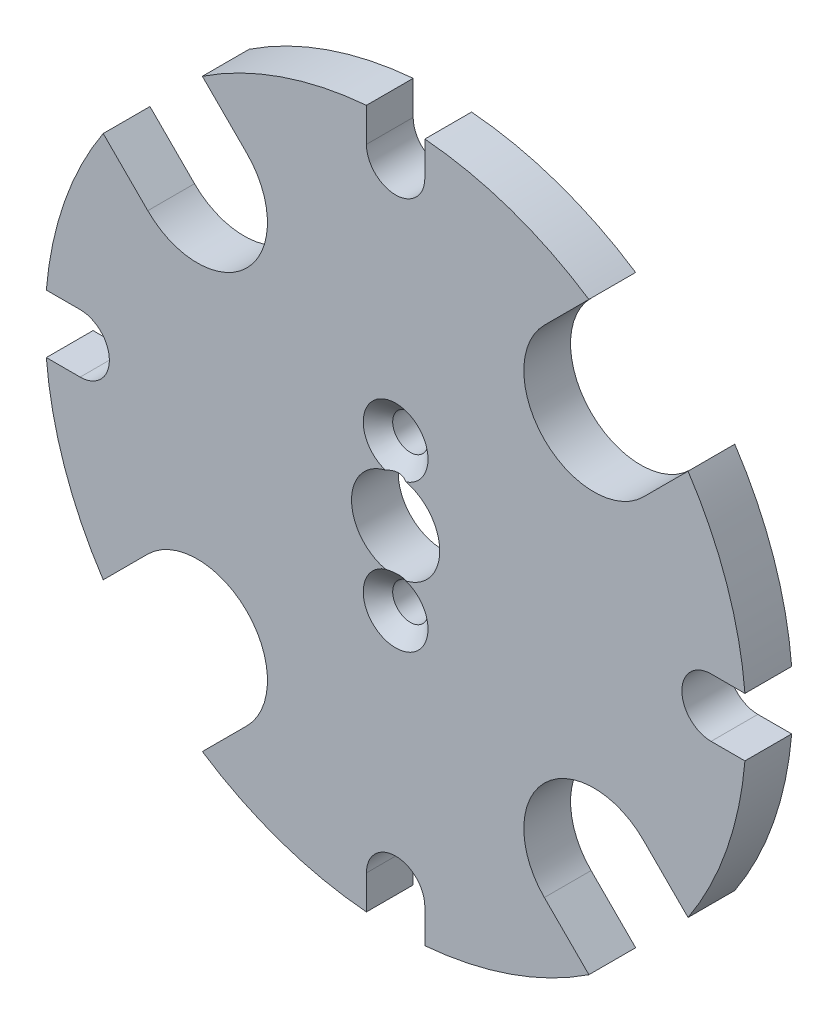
ISO-10303-21;
HEADER;
FILE_DESCRIPTION(('STEP AP214'),'2;1');
FILE_NAME('part.step','',(''),(''),'','','');
FILE_SCHEMA(('AUTOMOTIVE_DESIGN { 1 0 10303 214 1 1 1 1 }'));
ENDSEC;
DATA;
#1=APPLICATION_CONTEXT('core data for automotive mechanical design processes');
#2=APPLICATION_PROTOCOL_DEFINITION('international standard','automotive_design',2000,#1);
#3=PRODUCT_CONTEXT('',#1,'mechanical');
#4=PRODUCT('Part','Part','',(#3));
#5=PRODUCT_RELATED_PRODUCT_CATEGORY('part','',(#4));
#6=PRODUCT_DEFINITION_FORMATION('','',#4);
#7=PRODUCT_DEFINITION_CONTEXT('part definition',#1,'design');
#8=PRODUCT_DEFINITION('design','',#6,#7);
#9=PRODUCT_DEFINITION_SHAPE('','',#8);
#10=(LENGTH_UNIT() NAMED_UNIT(*) SI_UNIT(.MILLI.,.METRE.));
#11=(NAMED_UNIT(*) PLANE_ANGLE_UNIT() SI_UNIT($,.RADIAN.));
#12=(NAMED_UNIT(*) SI_UNIT($,.STERADIAN.) SOLID_ANGLE_UNIT());
#13=UNCERTAINTY_MEASURE_WITH_UNIT(LENGTH_MEASURE(1.E-05),#10,'distance_accuracy_value','');
#14=(GEOMETRIC_REPRESENTATION_CONTEXT(3) GLOBAL_UNCERTAINTY_ASSIGNED_CONTEXT((#13)) GLOBAL_UNIT_ASSIGNED_CONTEXT((#10,
#11,#12)) REPRESENTATION_CONTEXT('',''));
#15=CARTESIAN_POINT('',(0.,0.,0.));
#16=DIRECTION('',(0.,0.,1.));
#17=DIRECTION('',(1.,0.,0.));
#18=AXIS2_PLACEMENT_3D('',#15,#16,#17);
#19=CARTESIAN_POINT('',(21.43125,0.,3.175));
#20=DIRECTION('',(0.,0.,1.));
#21=DIRECTION('',(1.,0.,0.));
#22=AXIS2_PLACEMENT_3D('',#19,#20,#21);
#23=PLANE('',#22);
#24=CARTESIAN_POINT('',(0.,4.99872,3.175));
#25=DIRECTION('',(0.,0.,1.));
#26=DIRECTION('',(1.,0.,0.));
#27=AXIS2_PLACEMENT_3D('',#24,#25,#26);
#28=CIRCLE('',#27,2.2);
#29=CARTESIAN_POINT('',(0.70217795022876,2.91378687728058,3.175));
#30=VERTEX_POINT('',#29);
#31=CARTESIAN_POINT('',(-0.70217795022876,2.91378687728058,3.175));
#32=VERTEX_POINT('',#31);
#33=EDGE_CURVE('E56',#30,#32,#28,.T.);
#34=ORIENTED_EDGE('',*,*,#33,.F.);
#35=CARTESIAN_POINT('',(0.,0.,3.175));
#36=DIRECTION('',(0.,0.,1.));
#37=DIRECTION('',(1.,0.,0.));
#38=AXIS2_PLACEMENT_3D('',#35,#36,#37);
#39=CIRCLE('',#38,2.9972);
#40=CARTESIAN_POINT('',(0.69776664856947,-2.91484640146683,3.175));
#41=VERTEX_POINT('',#40);
#42=EDGE_CURVE('E269',#41,#30,#39,.T.);
#43=ORIENTED_EDGE('',*,*,#42,.F.);
#44=CARTESIAN_POINT('',(0.,-5.00126,3.175));
#45=DIRECTION('',(0.,0.,1.));
#46=DIRECTION('',(1.,0.,0.));
#47=AXIS2_PLACEMENT_3D('',#44,#45,#46);
#48=CIRCLE('',#47,2.2);
#49=CARTESIAN_POINT('',(-0.697766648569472,-2.91484640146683,3.175));
#50=VERTEX_POINT('',#49);
#51=EDGE_CURVE('E63',#50,#41,#48,.T.);
#52=ORIENTED_EDGE('',*,*,#51,.F.);
#53=EDGE_CURVE('E270',#32,#50,#39,.T.);
#54=ORIENTED_EDGE('',*,*,#53,.F.);
#55=EDGE_LOOP('',(#34,#43,#52,#54));
#56=FACE_BOUND('',#55,.T.);
#57=CARTESIAN_POINT('',(0.,0.,3.175));
#58=DIRECTION('',(0.,0.,1.));
#59=DIRECTION('',(1.,0.,0.));
#60=AXIS2_PLACEMENT_3D('',#57,#58,#59);
#61=CIRCLE('',#60,23.8125);
#62=CARTESIAN_POINT('',(23.7297267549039,1.98374,3.175));
#63=VERTEX_POINT('',#62);
#64=CARTESIAN_POINT('',(19.8653799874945,13.1301878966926,3.175));
#65=VERTEX_POINT('',#64);
#66=EDGE_CURVE('E367',#63,#65,#61,.T.);
#67=ORIENTED_EDGE('',*,*,#66,.T.);
#68=DIRECTION('',(0.707106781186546,0.707106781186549,0.));
#69=VECTOR('',#68,1.);
#70=CARTESIAN_POINT('',(16.8379802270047,10.1027881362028,3.175));
#71=LINE('',#70,#69);
#72=CARTESIAN_POINT('',(16.8379802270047,10.1027881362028,3.175));
#73=VERTEX_POINT('',#72);
#74=EDGE_CURVE('E586',#73,#65,#71,.T.);
#75=ORIENTED_EDGE('',*,*,#74,.F.);
#76=CARTESIAN_POINT('',(13.4703841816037,13.4703841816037,3.175));
#77=DIRECTION('',(0.,0.,1.));
#78=DIRECTION('',(1.,0.,0.));
#79=AXIS2_PLACEMENT_3D('',#76,#77,#78);
#80=CIRCLE('',#79,4.7625);
#81=CARTESIAN_POINT('',(10.1027881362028,16.8379802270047,3.175));
#82=VERTEX_POINT('',#81);
#83=EDGE_CURVE('E588',#82,#73,#80,.T.);
#84=ORIENTED_EDGE('',*,*,#83,.F.);
#85=DIRECTION('',(0.707106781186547,0.707106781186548,0.));
#86=VECTOR('',#85,1.);
#87=CARTESIAN_POINT('',(10.1027881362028,16.8379802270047,3.175));
#88=LINE('',#87,#86);
#89=CARTESIAN_POINT('',(13.1301878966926,19.8653799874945,3.175));
#90=VERTEX_POINT('',#89);
#91=EDGE_CURVE('E590',#82,#90,#88,.T.);
#92=ORIENTED_EDGE('',*,*,#91,.T.);
#93=CARTESIAN_POINT('',(1.98374000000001,23.7297267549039,3.175));
#94=VERTEX_POINT('',#93);
#95=EDGE_CURVE('E366',#90,#94,#61,.T.);
#96=ORIENTED_EDGE('',*,*,#95,.T.);
#97=DIRECTION('',(0.,1.,0.));
#98=VECTOR('',#97,1.);
#99=CARTESIAN_POINT('',(1.98374000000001,21.43125,3.175));
#100=LINE('',#99,#98);
#101=CARTESIAN_POINT('',(1.98374000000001,21.43125,3.175));
#102=VERTEX_POINT('',#101);
#103=EDGE_CURVE('E363',#102,#94,#100,.T.);
#104=ORIENTED_EDGE('',*,*,#103,.F.);
#105=CARTESIAN_POINT('',(0.,21.43125,3.175));
#106=DIRECTION('',(0.,0.,-1.));
#107=DIRECTION('',(-1.,0.,0.));
#108=AXIS2_PLACEMENT_3D('',#105,#106,#107);
#109=CIRCLE('',#108,1.98374);
#110=CARTESIAN_POINT('',(-1.98374,21.43125,3.175));
#111=VERTEX_POINT('',#110);
#112=EDGE_CURVE('E361',#102,#111,#109,.T.);
#113=ORIENTED_EDGE('',*,*,#112,.T.);
#114=DIRECTION('',(0.,1.,0.));
#115=VECTOR('',#114,1.);
#116=CARTESIAN_POINT('',(-1.98373999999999,21.43125,3.175));
#117=LINE('',#116,#115);
#118=CARTESIAN_POINT('',(-1.98373999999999,23.7297267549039,3.175));
#119=VERTEX_POINT('',#118);
#120=EDGE_CURVE('E359',#111,#119,#117,.T.);
#121=ORIENTED_EDGE('',*,*,#120,.T.);
#122=CARTESIAN_POINT('',(0.,0.,3.175));
#123=DIRECTION('',(0.,0.,1.));
#124=DIRECTION('',(1.,0.,0.));
#125=AXIS2_PLACEMENT_3D('',#122,#123,#124);
#126=CIRCLE('',#125,23.8125);
#127=CARTESIAN_POINT('',(-13.1301878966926,19.8653799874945,3.175));
#128=VERTEX_POINT('',#127);
#129=EDGE_CURVE('E356',#119,#128,#126,.T.);
#130=ORIENTED_EDGE('',*,*,#129,.T.);
#131=DIRECTION('',(-0.707106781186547,0.707106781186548,0.));
#132=VECTOR('',#131,1.);
#133=CARTESIAN_POINT('',(-10.1027881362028,16.8379802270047,3.175));
#134=LINE('',#133,#132);
#135=CARTESIAN_POINT('',(-10.1027881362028,16.8379802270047,3.175));
#136=VERTEX_POINT('',#135);
#137=EDGE_CURVE('E653',#136,#128,#134,.T.);
#138=ORIENTED_EDGE('',*,*,#137,.F.);
#139=CARTESIAN_POINT('',(-13.4703841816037,13.4703841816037,3.175));
#140=DIRECTION('',(0.,0.,-1.));
#141=DIRECTION('',(-1.,0.,0.));
#142=AXIS2_PLACEMENT_3D('',#139,#140,#141);
#143=CIRCLE('',#142,4.7625);
#144=CARTESIAN_POINT('',(-16.8379802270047,10.1027881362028,3.175));
#145=VERTEX_POINT('',#144);
#146=EDGE_CURVE('E655',#136,#145,#143,.T.);
#147=ORIENTED_EDGE('',*,*,#146,.T.);
#148=DIRECTION('',(-0.707106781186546,0.707106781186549,0.));
#149=VECTOR('',#148,1.);
#150=CARTESIAN_POINT('',(-16.8379802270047,10.1027881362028,3.175));
#151=LINE('',#150,#149);
#152=CARTESIAN_POINT('',(-19.8653799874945,13.1301878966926,3.175));
#153=VERTEX_POINT('',#152);
#154=EDGE_CURVE('E650',#145,#153,#151,.T.);
#155=ORIENTED_EDGE('',*,*,#154,.T.);
#156=CARTESIAN_POINT('',(-23.7297267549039,1.98374,3.175));
#157=VERTEX_POINT('',#156);
#158=EDGE_CURVE('E355',#153,#157,#126,.T.);
#159=ORIENTED_EDGE('',*,*,#158,.T.);
#160=DIRECTION('',(1.,0.,0.));
#161=VECTOR('',#160,1.);
#162=CARTESIAN_POINT('',(-23.7297267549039,1.98374,3.175));
#163=LINE('',#162,#161);
#164=CARTESIAN_POINT('',(-21.43125,1.98374,3.175));
#165=VERTEX_POINT('',#164);
#166=EDGE_CURVE('E353',#157,#165,#163,.T.);
#167=ORIENTED_EDGE('',*,*,#166,.T.);
#168=CARTESIAN_POINT('',(-21.43125,0.,3.175));
#169=DIRECTION('',(0.,0.,-1.));
#170=DIRECTION('',(-1.,0.,0.));
#171=AXIS2_PLACEMENT_3D('',#168,#169,#170);
#172=CIRCLE('',#171,1.98374);
#173=CARTESIAN_POINT('',(-21.43125,-1.98374,3.175));
#174=VERTEX_POINT('',#173);
#175=EDGE_CURVE('E351',#165,#174,#172,.T.);
#176=ORIENTED_EDGE('',*,*,#175,.T.);
#177=DIRECTION('',(-1.,0.,0.));
#178=VECTOR('',#177,1.);
#179=CARTESIAN_POINT('',(-21.43125,-1.98374,3.175));
#180=LINE('',#179,#178);
#181=CARTESIAN_POINT('',(-23.7297267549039,-1.98374,3.175));
#182=VERTEX_POINT('',#181);
#183=EDGE_CURVE('E349',#174,#182,#180,.T.);
#184=ORIENTED_EDGE('',*,*,#183,.T.);
#185=CARTESIAN_POINT('',(0.,0.,3.175));
#186=DIRECTION('',(0.,0.,1.));
#187=DIRECTION('',(1.,0.,0.));
#188=AXIS2_PLACEMENT_3D('',#185,#186,#187);
#189=CIRCLE('',#188,23.8125);
#190=CARTESIAN_POINT('',(-19.8653799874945,-13.1301878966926,3.175));
#191=VERTEX_POINT('',#190);
#192=EDGE_CURVE('E346',#182,#191,#189,.T.);
#193=ORIENTED_EDGE('',*,*,#192,.T.);
#194=DIRECTION('',(-0.707106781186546,-0.707106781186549,0.));
#195=VECTOR('',#194,1.);
#196=CARTESIAN_POINT('',(-16.8379802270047,-10.1027881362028,3.175));
#197=LINE('',#196,#195);
#198=CARTESIAN_POINT('',(-16.8379802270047,-10.1027881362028,3.175));
#199=VERTEX_POINT('',#198);
#200=EDGE_CURVE('E612',#199,#191,#197,.T.);
#201=ORIENTED_EDGE('',*,*,#200,.F.);
#202=CARTESIAN_POINT('',(-13.4703841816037,-13.4703841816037,3.175));
#203=DIRECTION('',(0.,0.,1.));
#204=DIRECTION('',(1.,0.,0.));
#205=AXIS2_PLACEMENT_3D('',#202,#203,#204);
#206=CIRCLE('',#205,4.7625);
#207=CARTESIAN_POINT('',(-10.1027881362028,-16.8379802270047,3.175));
#208=VERTEX_POINT('',#207);
#209=EDGE_CURVE('E610',#208,#199,#206,.T.);
#210=ORIENTED_EDGE('',*,*,#209,.F.);
#211=DIRECTION('',(-0.707106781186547,-0.707106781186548,0.));
#212=VECTOR('',#211,1.);
#213=CARTESIAN_POINT('',(-10.1027881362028,-16.8379802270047,3.175));
#214=LINE('',#213,#212);
#215=CARTESIAN_POINT('',(-13.1301878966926,-19.8653799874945,3.175));
#216=VERTEX_POINT('',#215);
#217=EDGE_CURVE('E614',#208,#216,#214,.T.);
#218=ORIENTED_EDGE('',*,*,#217,.T.);
#219=CARTESIAN_POINT('',(-1.98374,-23.7297267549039,3.175));
#220=VERTEX_POINT('',#219);
#221=EDGE_CURVE('E345',#216,#220,#189,.T.);
#222=ORIENTED_EDGE('',*,*,#221,.T.);
#223=DIRECTION('',(0.,-1.,0.));
#224=VECTOR('',#223,1.);
#225=CARTESIAN_POINT('',(-1.98373999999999,-21.43125,3.175));
#226=LINE('',#225,#224);
#227=CARTESIAN_POINT('',(-1.98373999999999,-21.43125,3.175));
#228=VERTEX_POINT('',#227);
#229=EDGE_CURVE('E342',#228,#220,#226,.T.);
#230=ORIENTED_EDGE('',*,*,#229,.F.);
#231=CARTESIAN_POINT('',(0.,-21.43125,3.175));
#232=DIRECTION('',(0.,0.,1.));
#233=DIRECTION('',(1.,0.,0.));
#234=AXIS2_PLACEMENT_3D('',#231,#232,#233);
#235=CIRCLE('',#234,1.98374);
#236=CARTESIAN_POINT('',(1.98374,-21.43125,3.175));
#237=VERTEX_POINT('',#236);
#238=EDGE_CURVE('E339',#237,#228,#235,.T.);
#239=ORIENTED_EDGE('',*,*,#238,.F.);
#240=DIRECTION('',(0.,-1.,0.));
#241=VECTOR('',#240,1.);
#242=CARTESIAN_POINT('',(1.98374000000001,-21.43125,3.175));
#243=LINE('',#242,#241);
#244=CARTESIAN_POINT('',(1.98374,-23.7297267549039,3.175));
#245=VERTEX_POINT('',#244);
#246=EDGE_CURVE('E337',#237,#245,#243,.T.);
#247=ORIENTED_EDGE('',*,*,#246,.T.);
#248=CARTESIAN_POINT('',(0.,0.,3.175));
#249=DIRECTION('',(0.,0.,1.));
#250=DIRECTION('',(1.,0.,0.));
#251=AXIS2_PLACEMENT_3D('',#248,#249,#250);
#252=CIRCLE('',#251,23.8125);
#253=CARTESIAN_POINT('',(13.1301878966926,-19.8653799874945,3.175));
#254=VERTEX_POINT('',#253);
#255=EDGE_CURVE('E334',#245,#254,#252,.T.);
#256=ORIENTED_EDGE('',*,*,#255,.T.);
#257=DIRECTION('',(0.707106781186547,-0.707106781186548,0.));
#258=VECTOR('',#257,1.);
#259=CARTESIAN_POINT('',(10.1027881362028,-16.8379802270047,3.175));
#260=LINE('',#259,#258);
#261=CARTESIAN_POINT('',(10.1027881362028,-16.8379802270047,3.175));
#262=VERTEX_POINT('',#261);
#263=EDGE_CURVE('E633',#262,#254,#260,.T.);
#264=ORIENTED_EDGE('',*,*,#263,.F.);
#265=CARTESIAN_POINT('',(13.4703841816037,-13.4703841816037,3.175));
#266=DIRECTION('',(0.,0.,-1.));
#267=DIRECTION('',(-1.,0.,0.));
#268=AXIS2_PLACEMENT_3D('',#265,#266,#267);
#269=CIRCLE('',#268,4.7625);
#270=CARTESIAN_POINT('',(16.8379802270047,-10.1027881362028,3.175));
#271=VERTEX_POINT('',#270);
#272=EDGE_CURVE('E635',#262,#271,#269,.T.);
#273=ORIENTED_EDGE('',*,*,#272,.T.);
#274=DIRECTION('',(0.707106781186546,-0.707106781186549,0.));
#275=VECTOR('',#274,1.);
#276=CARTESIAN_POINT('',(16.8379802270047,-10.1027881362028,3.175));
#277=LINE('',#276,#275);
#278=CARTESIAN_POINT('',(19.8653799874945,-13.1301878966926,3.175));
#279=VERTEX_POINT('',#278);
#280=EDGE_CURVE('E630',#271,#279,#277,.T.);
#281=ORIENTED_EDGE('',*,*,#280,.T.);
#282=CARTESIAN_POINT('',(23.7297267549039,-1.98374,3.175));
#283=VERTEX_POINT('',#282);
#284=EDGE_CURVE('E333',#279,#283,#252,.T.);
#285=ORIENTED_EDGE('',*,*,#284,.T.);
#286=DIRECTION('',(1.,0.,0.));
#287=VECTOR('',#286,1.);
#288=CARTESIAN_POINT('',(21.43125,-1.98374,3.175));
#289=LINE('',#288,#287);
#290=CARTESIAN_POINT('',(21.43125,-1.98374,3.175));
#291=VERTEX_POINT('',#290);
#292=EDGE_CURVE('E330',#291,#283,#289,.T.);
#293=ORIENTED_EDGE('',*,*,#292,.F.);
#294=CARTESIAN_POINT('',(21.43125,0.,3.175));
#295=DIRECTION('',(0.,0.,1.));
#296=DIRECTION('',(1.,0.,0.));
#297=AXIS2_PLACEMENT_3D('',#294,#295,#296);
#298=CIRCLE('',#297,1.98374);
#299=CARTESIAN_POINT('',(21.43125,1.98374,3.175));
#300=VERTEX_POINT('',#299);
#301=EDGE_CURVE('E327',#300,#291,#298,.T.);
#302=ORIENTED_EDGE('',*,*,#301,.F.);
#303=DIRECTION('',(-1.,0.,0.));
#304=VECTOR('',#303,1.);
#305=CARTESIAN_POINT('',(23.7297267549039,1.98374,3.175));
#306=LINE('',#305,#304);
#307=EDGE_CURVE('E370',#63,#300,#306,.T.);
#308=ORIENTED_EDGE('',*,*,#307,.F.);
#309=EDGE_LOOP('',(#67,#75,#84,#92,#96,#104,#113,#121,#130,#138,#147,#155,#159,#167,#176,#184,
#193,#201,#210,#218,#222,#230,#239,#247,#256,#264,#273,#281,#285,#293,#302,#308));
#310=FACE_BOUND('',#309,.T.);
#311=ADVANCED_FACE('F38',(#56,#310),#23,.T.);
#312=CARTESIAN_POINT('',(21.43125,0.,0.));
#313=DIRECTION('',(0.,0.,1.));
#314=DIRECTION('',(1.,0.,0.));
#315=AXIS2_PLACEMENT_3D('',#312,#313,#314);
#316=PLANE('',#315);
#317=CARTESIAN_POINT('',(0.,4.99872,0.));
#318=DIRECTION('',(0.,0.,1.));
#319=DIRECTION('',(1.,0.,0.));
#320=AXIS2_PLACEMENT_3D('',#317,#318,#319);
#321=CIRCLE('',#320,1.2);
#322=CARTESIAN_POINT('',(1.2,4.99872,0.));
#323=VERTEX_POINT('',#322);
#324=EDGE_CURVE('E703',#323,#323,#321,.T.);
#325=ORIENTED_EDGE('',*,*,#324,.T.);
#326=EDGE_LOOP('',(#325));
#327=FACE_BOUND('',#326,.T.);
#328=CARTESIAN_POINT('',(0.,-5.00126,0.));
#329=DIRECTION('',(0.,0.,1.));
#330=DIRECTION('',(1.,0.,0.));
#331=AXIS2_PLACEMENT_3D('',#328,#329,#330);
#332=CIRCLE('',#331,1.2);
#333=CARTESIAN_POINT('',(1.2,-5.00126,0.));
#334=VERTEX_POINT('',#333);
#335=EDGE_CURVE('E271',#334,#334,#332,.T.);
#336=ORIENTED_EDGE('',*,*,#335,.T.);
#337=EDGE_LOOP('',(#336));
#338=FACE_BOUND('',#337,.T.);
#339=CARTESIAN_POINT('',(0.,0.,0.));
#340=DIRECTION('',(0.,0.,1.));
#341=DIRECTION('',(1.,0.,0.));
#342=AXIS2_PLACEMENT_3D('',#339,#340,#341);
#343=CIRCLE('',#342,2.9972);
#344=CARTESIAN_POINT('',(2.9972,0.,0.));
#345=VERTEX_POINT('',#344);
#346=EDGE_CURVE('E281',#345,#345,#343,.T.);
#347=ORIENTED_EDGE('',*,*,#346,.T.);
#348=EDGE_LOOP('',(#347));
#349=FACE_BOUND('',#348,.T.);
#350=DIRECTION('',(0.707106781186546,0.707106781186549,0.));
#351=VECTOR('',#350,1.);
#352=CARTESIAN_POINT('',(16.8379802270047,10.1027881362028,0.));
#353=LINE('',#352,#351);
#354=CARTESIAN_POINT('',(16.8379802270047,10.1027881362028,0.));
#355=VERTEX_POINT('',#354);
#356=CARTESIAN_POINT('',(19.8653799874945,13.1301878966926,0.));
#357=VERTEX_POINT('',#356);
#358=EDGE_CURVE('E690',#355,#357,#353,.T.);
#359=ORIENTED_EDGE('',*,*,#358,.T.);
#360=CARTESIAN_POINT('',(0.,0.,0.));
#361=DIRECTION('',(0.,0.,1.));
#362=DIRECTION('',(1.,0.,0.));
#363=AXIS2_PLACEMENT_3D('',#360,#361,#362);
#364=CIRCLE('',#363,23.8125);
#365=CARTESIAN_POINT('',(23.7297267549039,1.98374,0.));
#366=VERTEX_POINT('',#365);
#367=EDGE_CURVE('E321',#366,#357,#364,.T.);
#368=ORIENTED_EDGE('',*,*,#367,.F.);
#369=DIRECTION('',(-1.,0.,0.));
#370=VECTOR('',#369,1.);
#371=CARTESIAN_POINT('',(23.7297267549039,1.98374,0.));
#372=LINE('',#371,#370);
#373=CARTESIAN_POINT('',(21.43125,1.98374,0.));
#374=VERTEX_POINT('',#373);
#375=EDGE_CURVE('E324',#366,#374,#372,.T.);
#376=ORIENTED_EDGE('',*,*,#375,.T.);
#377=CARTESIAN_POINT('',(21.43125,0.,0.));
#378=DIRECTION('',(0.,0.,1.));
#379=DIRECTION('',(1.,0.,0.));
#380=AXIS2_PLACEMENT_3D('',#377,#378,#379);
#381=CIRCLE('',#380,1.98374);
#382=CARTESIAN_POINT('',(21.43125,-1.98374,0.));
#383=VERTEX_POINT('',#382);
#384=EDGE_CURVE('E276',#374,#383,#381,.T.);
#385=ORIENTED_EDGE('',*,*,#384,.T.);
#386=DIRECTION('',(1.,0.,0.));
#387=VECTOR('',#386,1.);
#388=CARTESIAN_POINT('',(21.43125,-1.98374,0.));
#389=LINE('',#388,#387);
#390=CARTESIAN_POINT('',(23.7297267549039,-1.98374,0.));
#391=VERTEX_POINT('',#390);
#392=EDGE_CURVE('E279',#383,#391,#389,.T.);
#393=ORIENTED_EDGE('',*,*,#392,.T.);
#394=CARTESIAN_POINT('',(0.,0.,0.));
#395=DIRECTION('',(0.,0.,1.));
#396=DIRECTION('',(1.,0.,0.));
#397=AXIS2_PLACEMENT_3D('',#394,#395,#396);
#398=CIRCLE('',#397,23.8125);
#399=CARTESIAN_POINT('',(19.8653799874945,-13.1301878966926,0.));
#400=VERTEX_POINT('',#399);
#401=EDGE_CURVE('E287',#400,#391,#398,.T.);
#402=ORIENTED_EDGE('',*,*,#401,.F.);
#403=DIRECTION('',(0.707106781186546,-0.707106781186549,0.));
#404=VECTOR('',#403,1.);
#405=CARTESIAN_POINT('',(16.8379802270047,-10.1027881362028,0.));
#406=LINE('',#405,#404);
#407=CARTESIAN_POINT('',(16.8379802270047,-10.1027881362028,0.));
#408=VERTEX_POINT('',#407);
#409=EDGE_CURVE('E622',#408,#400,#406,.T.);
#410=ORIENTED_EDGE('',*,*,#409,.F.);
#411=CARTESIAN_POINT('',(13.4703841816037,-13.4703841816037,0.));
#412=DIRECTION('',(0.,0.,-1.));
#413=DIRECTION('',(-1.,0.,0.));
#414=AXIS2_PLACEMENT_3D('',#411,#412,#413);
#415=CIRCLE('',#414,4.7625);
#416=CARTESIAN_POINT('',(10.1027881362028,-16.8379802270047,0.));
#417=VERTEX_POINT('',#416);
#418=EDGE_CURVE('E627',#417,#408,#415,.T.);
#419=ORIENTED_EDGE('',*,*,#418,.F.);
#420=DIRECTION('',(0.707106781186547,-0.707106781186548,0.));
#421=VECTOR('',#420,1.);
#422=CARTESIAN_POINT('',(10.1027881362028,-16.8379802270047,0.));
#423=LINE('',#422,#421);
#424=CARTESIAN_POINT('',(13.1301878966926,-19.8653799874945,0.));
#425=VERTEX_POINT('',#424);
#426=EDGE_CURVE('E624',#417,#425,#423,.T.);
#427=ORIENTED_EDGE('',*,*,#426,.T.);
#428=CARTESIAN_POINT('',(1.98374,-23.7297267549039,0.));
#429=VERTEX_POINT('',#428);
#430=EDGE_CURVE('E288',#429,#425,#398,.T.);
#431=ORIENTED_EDGE('',*,*,#430,.F.);
#432=DIRECTION('',(0.,-1.,0.));
#433=VECTOR('',#432,1.);
#434=CARTESIAN_POINT('',(1.98374000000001,-21.43125,0.));
#435=LINE('',#434,#433);
#436=CARTESIAN_POINT('',(1.98374,-21.43125,0.));
#437=VERTEX_POINT('',#436);
#438=EDGE_CURVE('E291',#437,#429,#435,.T.);
#439=ORIENTED_EDGE('',*,*,#438,.F.);
#440=CARTESIAN_POINT('',(0.,-21.43125,0.));
#441=DIRECTION('',(0.,0.,1.));
#442=DIRECTION('',(1.,0.,0.));
#443=AXIS2_PLACEMENT_3D('',#440,#441,#442);
#444=CIRCLE('',#443,1.98374);
#445=CARTESIAN_POINT('',(-1.98373999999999,-21.43125,0.));
#446=VERTEX_POINT('',#445);
#447=EDGE_CURVE('E293',#437,#446,#444,.T.);
#448=ORIENTED_EDGE('',*,*,#447,.T.);
#449=DIRECTION('',(0.,-1.,0.));
#450=VECTOR('',#449,1.);
#451=CARTESIAN_POINT('',(-1.98373999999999,-21.43125,0.));
#452=LINE('',#451,#450);
#453=CARTESIAN_POINT('',(-1.98374,-23.7297267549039,0.));
#454=VERTEX_POINT('',#453);
#455=EDGE_CURVE('E296',#446,#454,#452,.T.);
#456=ORIENTED_EDGE('',*,*,#455,.T.);
#457=CARTESIAN_POINT('',(0.,0.,0.));
#458=DIRECTION('',(0.,0.,1.));
#459=DIRECTION('',(1.,0.,0.));
#460=AXIS2_PLACEMENT_3D('',#457,#458,#459);
#461=CIRCLE('',#460,23.8125);
#462=CARTESIAN_POINT('',(-13.1301878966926,-19.8653799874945,0.));
#463=VERTEX_POINT('',#462);
#464=EDGE_CURVE('E299',#463,#454,#461,.T.);
#465=ORIENTED_EDGE('',*,*,#464,.F.);
#466=DIRECTION('',(-0.707106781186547,-0.707106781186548,0.));
#467=VECTOR('',#466,1.);
#468=CARTESIAN_POINT('',(-10.1027881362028,-16.8379802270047,0.));
#469=LINE('',#468,#467);
#470=CARTESIAN_POINT('',(-10.1027881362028,-16.8379802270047,0.));
#471=VERTEX_POINT('',#470);
#472=EDGE_CURVE('E608',#471,#463,#469,.T.);
#473=ORIENTED_EDGE('',*,*,#472,.F.);
#474=CARTESIAN_POINT('',(-13.4703841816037,-13.4703841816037,0.));
#475=DIRECTION('',(0.,0.,1.));
#476=DIRECTION('',(1.,0.,0.));
#477=AXIS2_PLACEMENT_3D('',#474,#475,#476);
#478=CIRCLE('',#477,4.7625);
#479=CARTESIAN_POINT('',(-16.8379802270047,-10.1027881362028,0.));
#480=VERTEX_POINT('',#479);
#481=EDGE_CURVE('E602',#471,#480,#478,.T.);
#482=ORIENTED_EDGE('',*,*,#481,.T.);
#483=DIRECTION('',(-0.707106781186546,-0.707106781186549,0.));
#484=VECTOR('',#483,1.);
#485=CARTESIAN_POINT('',(-16.8379802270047,-10.1027881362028,0.));
#486=LINE('',#485,#484);
#487=CARTESIAN_POINT('',(-19.8653799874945,-13.1301878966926,0.));
#488=VERTEX_POINT('',#487);
#489=EDGE_CURVE('E605',#480,#488,#486,.T.);
#490=ORIENTED_EDGE('',*,*,#489,.T.);
#491=CARTESIAN_POINT('',(-23.7297267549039,-1.98374,0.));
#492=VERTEX_POINT('',#491);
#493=EDGE_CURVE('E300',#492,#488,#461,.T.);
#494=ORIENTED_EDGE('',*,*,#493,.F.);
#495=DIRECTION('',(-1.,0.,0.));
#496=VECTOR('',#495,1.);
#497=CARTESIAN_POINT('',(-21.43125,-1.98374,0.));
#498=LINE('',#497,#496);
#499=CARTESIAN_POINT('',(-21.43125,-1.98374,0.));
#500=VERTEX_POINT('',#499);
#501=EDGE_CURVE('E303',#500,#492,#498,.T.);
#502=ORIENTED_EDGE('',*,*,#501,.F.);
#503=CARTESIAN_POINT('',(-21.43125,0.,0.));
#504=DIRECTION('',(0.,0.,-1.));
#505=DIRECTION('',(-1.,0.,0.));
#506=AXIS2_PLACEMENT_3D('',#503,#504,#505);
#507=CIRCLE('',#506,1.98374);
#508=CARTESIAN_POINT('',(-21.43125,1.98374,0.));
#509=VERTEX_POINT('',#508);
#510=EDGE_CURVE('E305',#509,#500,#507,.T.);
#511=ORIENTED_EDGE('',*,*,#510,.F.);
#512=DIRECTION('',(1.,0.,0.));
#513=VECTOR('',#512,1.);
#514=CARTESIAN_POINT('',(-23.7297267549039,1.98374,0.));
#515=LINE('',#514,#513);
#516=CARTESIAN_POINT('',(-23.7297267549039,1.98374,0.));
#517=VERTEX_POINT('',#516);
#518=EDGE_CURVE('E307',#517,#509,#515,.T.);
#519=ORIENTED_EDGE('',*,*,#518,.F.);
#520=CARTESIAN_POINT('',(0.,0.,0.));
#521=DIRECTION('',(0.,0.,1.));
#522=DIRECTION('',(1.,0.,0.));
#523=AXIS2_PLACEMENT_3D('',#520,#521,#522);
#524=CIRCLE('',#523,23.8125);
#525=CARTESIAN_POINT('',(-19.8653799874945,13.1301878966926,0.));
#526=VERTEX_POINT('',#525);
#527=EDGE_CURVE('E309',#526,#517,#524,.T.);
#528=ORIENTED_EDGE('',*,*,#527,.F.);
#529=DIRECTION('',(-0.707106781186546,0.707106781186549,0.));
#530=VECTOR('',#529,1.);
#531=CARTESIAN_POINT('',(-16.8379802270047,10.1027881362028,0.));
#532=LINE('',#531,#530);
#533=CARTESIAN_POINT('',(-16.8379802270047,10.1027881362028,0.));
#534=VERTEX_POINT('',#533);
#535=EDGE_CURVE('E641',#534,#526,#532,.T.);
#536=ORIENTED_EDGE('',*,*,#535,.F.);
#537=CARTESIAN_POINT('',(-13.4703841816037,13.4703841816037,0.));
#538=DIRECTION('',(0.,0.,-1.));
#539=DIRECTION('',(-1.,0.,0.));
#540=AXIS2_PLACEMENT_3D('',#537,#538,#539);
#541=CIRCLE('',#540,4.7625);
#542=CARTESIAN_POINT('',(-10.1027881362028,16.8379802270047,0.));
#543=VERTEX_POINT('',#542);
#544=EDGE_CURVE('E647',#543,#534,#541,.T.);
#545=ORIENTED_EDGE('',*,*,#544,.F.);
#546=DIRECTION('',(-0.707106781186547,0.707106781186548,0.));
#547=VECTOR('',#546,1.);
#548=CARTESIAN_POINT('',(-10.1027881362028,16.8379802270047,0.));
#549=LINE('',#548,#547);
#550=CARTESIAN_POINT('',(-13.1301878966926,19.8653799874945,0.));
#551=VERTEX_POINT('',#550);
#552=EDGE_CURVE('E644',#543,#551,#549,.T.);
#553=ORIENTED_EDGE('',*,*,#552,.T.);
#554=CARTESIAN_POINT('',(-1.98373999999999,23.7297267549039,0.));
#555=VERTEX_POINT('',#554);
#556=EDGE_CURVE('E310',#555,#551,#524,.T.);
#557=ORIENTED_EDGE('',*,*,#556,.F.);
#558=DIRECTION('',(0.,1.,0.));
#559=VECTOR('',#558,1.);
#560=CARTESIAN_POINT('',(-1.98373999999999,21.43125,0.));
#561=LINE('',#560,#559);
#562=CARTESIAN_POINT('',(-1.98374,21.43125,0.));
#563=VERTEX_POINT('',#562);
#564=EDGE_CURVE('E313',#563,#555,#561,.T.);
#565=ORIENTED_EDGE('',*,*,#564,.F.);
#566=CARTESIAN_POINT('',(0.,21.43125,0.));
#567=DIRECTION('',(0.,0.,-1.));
#568=DIRECTION('',(-1.,0.,0.));
#569=AXIS2_PLACEMENT_3D('',#566,#567,#568);
#570=CIRCLE('',#569,1.98374);
#571=CARTESIAN_POINT('',(1.98374000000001,21.43125,0.));
#572=VERTEX_POINT('',#571);
#573=EDGE_CURVE('E315',#572,#563,#570,.T.);
#574=ORIENTED_EDGE('',*,*,#573,.F.);
#575=DIRECTION('',(0.,1.,0.));
#576=VECTOR('',#575,1.);
#577=CARTESIAN_POINT('',(1.98374000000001,21.43125,0.));
#578=LINE('',#577,#576);
#579=CARTESIAN_POINT('',(1.98374000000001,23.7297267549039,0.));
#580=VERTEX_POINT('',#579);
#581=EDGE_CURVE('E317',#572,#580,#578,.T.);
#582=ORIENTED_EDGE('',*,*,#581,.T.);
#583=CARTESIAN_POINT('',(13.1301878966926,19.8653799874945,0.));
#584=VERTEX_POINT('',#583);
#585=EDGE_CURVE('E320',#584,#580,#364,.T.);
#586=ORIENTED_EDGE('',*,*,#585,.F.);
#587=DIRECTION('',(0.707106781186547,0.707106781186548,0.));
#588=VECTOR('',#587,1.);
#589=CARTESIAN_POINT('',(10.1027881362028,16.8379802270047,0.));
#590=LINE('',#589,#588);
#591=CARTESIAN_POINT('',(10.1027881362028,16.8379802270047,0.));
#592=VERTEX_POINT('',#591);
#593=EDGE_CURVE('E594',#592,#584,#590,.T.);
#594=ORIENTED_EDGE('',*,*,#593,.F.);
#595=CARTESIAN_POINT('',(13.4703841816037,13.4703841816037,0.));
#596=DIRECTION('',(0.,0.,1.));
#597=DIRECTION('',(1.,0.,0.));
#598=AXIS2_PLACEMENT_3D('',#595,#596,#597);
#599=CIRCLE('',#598,4.7625);
#600=EDGE_CURVE('E691',#592,#355,#599,.T.);
#601=ORIENTED_EDGE('',*,*,#600,.T.);
#602=EDGE_LOOP('',(#359,#368,#376,#385,#393,#402,#410,#419,#427,#431,#439,#448,#456,#465,#473,
#482,#490,#494,#502,#511,#519,#528,#536,#545,#553,#557,#565,#574,#582,#586,#594,#601));
#603=FACE_BOUND('',#602,.T.);
#604=ADVANCED_FACE('F499',(#327,#338,#349,#603),#316,.F.);
#605=CARTESIAN_POINT('',(0.,0.,3.175));
#606=DIRECTION('',(0.,0.,-1.));
#607=DIRECTION('',(-1.,0.,0.));
#608=AXIS2_PLACEMENT_3D('',#605,#606,#607);
#609=CYLINDRICAL_SURFACE('',#608,23.8125);
#610=DIRECTION('',(0.,0.,-1.));
#611=VECTOR('',#610,1.);
#612=CARTESIAN_POINT('',(19.8653799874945,13.1301878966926,3.175));
#613=LINE('',#612,#611);
#614=EDGE_CURVE('E433',#65,#357,#613,.T.);
#615=ORIENTED_EDGE('',*,*,#614,.F.);
#616=ORIENTED_EDGE('',*,*,#66,.F.);
#617=DIRECTION('',(0.,0.,-1.));
#618=VECTOR('',#617,1.);
#619=CARTESIAN_POINT('',(23.7297267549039,1.98374,3.175));
#620=LINE('',#619,#618);
#621=EDGE_CURVE('E377',#63,#366,#620,.T.);
#622=ORIENTED_EDGE('',*,*,#621,.T.);
#623=ORIENTED_EDGE('',*,*,#367,.T.);
#624=EDGE_LOOP('',(#615,#616,#622,#623));
#625=FACE_BOUND('',#624,.T.);
#626=ADVANCED_FACE('F504',(#625),#609,.T.);
#627=CARTESIAN_POINT('',(0.,0.,3.175));
#628=DIRECTION('',(0.,0.,-1.));
#629=DIRECTION('',(-1.,0.,0.));
#630=AXIS2_PLACEMENT_3D('',#627,#628,#629);
#631=CYLINDRICAL_SURFACE('',#630,23.8125);
#632=DIRECTION('',(0.,0.,-1.));
#633=VECTOR('',#632,1.);
#634=CARTESIAN_POINT('',(-19.8653799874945,-13.1301878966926,3.175));
#635=LINE('',#634,#633);
#636=EDGE_CURVE('E428',#191,#488,#635,.T.);
#637=ORIENTED_EDGE('',*,*,#636,.F.);
#638=ORIENTED_EDGE('',*,*,#192,.F.);
#639=DIRECTION('',(0.,0.,-1.));
#640=VECTOR('',#639,1.);
#641=CARTESIAN_POINT('',(-23.7297267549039,-1.98374,3.175));
#642=LINE('',#641,#640);
#643=EDGE_CURVE('E399',#182,#492,#642,.T.);
#644=ORIENTED_EDGE('',*,*,#643,.T.);
#645=ORIENTED_EDGE('',*,*,#493,.T.);
#646=EDGE_LOOP('',(#637,#638,#644,#645));
#647=FACE_BOUND('',#646,.T.);
#648=ADVANCED_FACE('F549',(#647),#631,.T.);
#649=CARTESIAN_POINT('',(0.,0.,3.175));
#650=DIRECTION('',(0.,0.,-1.));
#651=DIRECTION('',(-1.,0.,0.));
#652=AXIS2_PLACEMENT_3D('',#649,#650,#651);
#653=CYLINDRICAL_SURFACE('',#652,23.8125);
#654=DIRECTION('',(0.,0.,-1.));
#655=VECTOR('',#654,1.);
#656=CARTESIAN_POINT('',(13.1301878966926,-19.8653799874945,3.175));
#657=LINE('',#656,#655);
#658=EDGE_CURVE('E420',#254,#425,#657,.T.);
#659=ORIENTED_EDGE('',*,*,#658,.F.);
#660=ORIENTED_EDGE('',*,*,#255,.F.);
#661=DIRECTION('',(0.,0.,-1.));
#662=VECTOR('',#661,1.);
#663=CARTESIAN_POINT('',(1.98374,-23.7297267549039,3.175));
#664=LINE('',#663,#662);
#665=EDGE_CURVE('E409',#245,#429,#664,.T.);
#666=ORIENTED_EDGE('',*,*,#665,.T.);
#667=ORIENTED_EDGE('',*,*,#430,.T.);
#668=EDGE_LOOP('',(#659,#660,#666,#667));
#669=FACE_BOUND('',#668,.T.);
#670=ADVANCED_FACE('F564',(#669),#653,.T.);
#671=CARTESIAN_POINT('',(0.,0.,3.175));
#672=DIRECTION('',(0.,0.,-1.));
#673=DIRECTION('',(-1.,0.,0.));
#674=AXIS2_PLACEMENT_3D('',#671,#672,#673);
#675=CYLINDRICAL_SURFACE('',#674,23.8125);
#676=DIRECTION('',(0.,0.,-1.));
#677=VECTOR('',#676,1.);
#678=CARTESIAN_POINT('',(-13.1301878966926,19.8653799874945,3.175));
#679=LINE('',#678,#677);
#680=EDGE_CURVE('E376',#128,#551,#679,.T.);
#681=ORIENTED_EDGE('',*,*,#680,.F.);
#682=ORIENTED_EDGE('',*,*,#129,.F.);
#683=DIRECTION('',(0.,0.,-1.));
#684=VECTOR('',#683,1.);
#685=CARTESIAN_POINT('',(-1.98373999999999,23.7297267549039,3.175));
#686=LINE('',#685,#684);
#687=EDGE_CURVE('E387',#119,#555,#686,.T.);
#688=ORIENTED_EDGE('',*,*,#687,.T.);
#689=ORIENTED_EDGE('',*,*,#556,.T.);
#690=EDGE_LOOP('',(#681,#682,#688,#689));
#691=FACE_BOUND('',#690,.T.);
#692=ADVANCED_FACE('F532',(#691),#675,.T.);
#693=CARTESIAN_POINT('',(21.43125,0.,3.175));
#694=DIRECTION('',(0.,0.,-1.));
#695=DIRECTION('',(-1.,0.,0.));
#696=AXIS2_PLACEMENT_3D('',#693,#694,#695);
#697=CYLINDRICAL_SURFACE('',#696,1.98374);
#698=ORIENTED_EDGE('',*,*,#384,.F.);
#699=DIRECTION('',(0.,0.,-1.));
#700=VECTOR('',#699,1.);
#701=CARTESIAN_POINT('',(21.43125,1.98374,3.175));
#702=LINE('',#701,#700);
#703=EDGE_CURVE('E374',#300,#374,#702,.T.);
#704=ORIENTED_EDGE('',*,*,#703,.F.);
#705=ORIENTED_EDGE('',*,*,#301,.T.);
#706=DIRECTION('',(0.,0.,-1.));
#707=VECTOR('',#706,1.);
#708=CARTESIAN_POINT('',(21.43125,-1.98374,3.175));
#709=LINE('',#708,#707);
#710=EDGE_CURVE('E373',#291,#383,#709,.T.);
#711=ORIENTED_EDGE('',*,*,#710,.T.);
#712=EDGE_LOOP('',(#698,#704,#705,#711));
#713=FACE_BOUND('',#712,.T.);
#714=ADVANCED_FACE('F40',(#713),#697,.F.);
#715=CARTESIAN_POINT('',(23.7297267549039,1.98374,3.175));
#716=DIRECTION('',(0.,-1.,0.));
#717=DIRECTION('',(1.,0.,0.));
#718=AXIS2_PLACEMENT_3D('',#715,#716,#717);
#719=PLANE('',#718);
#720=ORIENTED_EDGE('',*,*,#375,.F.);
#721=ORIENTED_EDGE('',*,*,#621,.F.);
#722=ORIENTED_EDGE('',*,*,#307,.T.);
#723=ORIENTED_EDGE('',*,*,#703,.T.);
#724=EDGE_LOOP('',(#720,#721,#722,#723));
#725=FACE_BOUND('',#724,.T.);
#726=ADVANCED_FACE('F507',(#725),#719,.T.);
#727=ORIENTED_EDGE('',*,*,#95,.F.);
#728=DIRECTION('',(0.,0.,-1.));
#729=VECTOR('',#728,1.);
#730=CARTESIAN_POINT('',(13.1301878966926,19.8653799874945,3.175));
#731=LINE('',#730,#729);
#732=EDGE_CURVE('E430',#90,#584,#731,.T.);
#733=ORIENTED_EDGE('',*,*,#732,.T.);
#734=ORIENTED_EDGE('',*,*,#585,.T.);
#735=DIRECTION('',(0.,0.,-1.));
#736=VECTOR('',#735,1.);
#737=CARTESIAN_POINT('',(1.98374000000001,23.7297267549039,3.175));
#738=LINE('',#737,#736);
#739=EDGE_CURVE('E379',#94,#580,#738,.T.);
#740=ORIENTED_EDGE('',*,*,#739,.F.);
#741=EDGE_LOOP('',(#727,#733,#734,#740));
#742=FACE_BOUND('',#741,.T.);
#743=ADVANCED_FACE('F510',(#742),#609,.T.);
#744=CARTESIAN_POINT('',(1.98374000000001,21.43125,3.175));
#745=DIRECTION('',(-1.,0.,0.));
#746=DIRECTION('',(0.,0.,1.));
#747=AXIS2_PLACEMENT_3D('',#744,#745,#746);
#748=PLANE('',#747);
#749=ORIENTED_EDGE('',*,*,#581,.F.);
#750=DIRECTION('',(0.,0.,-1.));
#751=VECTOR('',#750,1.);
#752=CARTESIAN_POINT('',(1.98374000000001,21.43125,3.175));
#753=LINE('',#752,#751);
#754=EDGE_CURVE('E382',#102,#572,#753,.T.);
#755=ORIENTED_EDGE('',*,*,#754,.F.);
#756=ORIENTED_EDGE('',*,*,#103,.T.);
#757=ORIENTED_EDGE('',*,*,#739,.T.);
#758=EDGE_LOOP('',(#749,#755,#756,#757));
#759=FACE_BOUND('',#758,.T.);
#760=ADVANCED_FACE('F514',(#759),#748,.T.);
#761=CARTESIAN_POINT('',(0.,21.43125,3.175));
#762=DIRECTION('',(0.,0.,-1.));
#763=DIRECTION('',(-1.,0.,0.));
#764=AXIS2_PLACEMENT_3D('',#761,#762,#763);
#765=CYLINDRICAL_SURFACE('',#764,1.98374);
#766=ORIENTED_EDGE('',*,*,#573,.T.);
#767=DIRECTION('',(0.,0.,-1.));
#768=VECTOR('',#767,1.);
#769=CARTESIAN_POINT('',(-1.98374,21.43125,3.175));
#770=LINE('',#769,#768);
#771=EDGE_CURVE('E384',#111,#563,#770,.T.);
#772=ORIENTED_EDGE('',*,*,#771,.F.);
#773=ORIENTED_EDGE('',*,*,#112,.F.);
#774=ORIENTED_EDGE('',*,*,#754,.T.);
#775=EDGE_LOOP('',(#766,#772,#773,#774));
#776=FACE_BOUND('',#775,.T.);
#777=ADVANCED_FACE('F518',(#776),#765,.F.);
#778=CARTESIAN_POINT('',(-1.98373999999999,21.43125,3.175));
#779=DIRECTION('',(-1.,0.,0.));
#780=DIRECTION('',(0.,-1.,0.));
#781=AXIS2_PLACEMENT_3D('',#778,#779,#780);
#782=PLANE('',#781);
#783=ORIENTED_EDGE('',*,*,#564,.T.);
#784=ORIENTED_EDGE('',*,*,#687,.F.);
#785=ORIENTED_EDGE('',*,*,#120,.F.);
#786=ORIENTED_EDGE('',*,*,#771,.T.);
#787=EDGE_LOOP('',(#783,#784,#785,#786));
#788=FACE_BOUND('',#787,.T.);
#789=ADVANCED_FACE('F522',(#788),#782,.F.);
#790=ORIENTED_EDGE('',*,*,#158,.F.);
#791=DIRECTION('',(0.,0.,-1.));
#792=VECTOR('',#791,1.);
#793=CARTESIAN_POINT('',(-19.8653799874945,13.1301878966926,3.175));
#794=LINE('',#793,#792);
#795=EDGE_CURVE('E417',#153,#526,#794,.T.);
#796=ORIENTED_EDGE('',*,*,#795,.T.);
#797=ORIENTED_EDGE('',*,*,#527,.T.);
#798=DIRECTION('',(0.,0.,-1.));
#799=VECTOR('',#798,1.);
#800=CARTESIAN_POINT('',(-23.7297267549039,1.98374,3.175));
#801=LINE('',#800,#799);
#802=EDGE_CURVE('E390',#157,#517,#801,.T.);
#803=ORIENTED_EDGE('',*,*,#802,.F.);
#804=EDGE_LOOP('',(#790,#796,#797,#803));
#805=FACE_BOUND('',#804,.T.);
#806=ADVANCED_FACE('F526',(#805),#675,.T.);
#807=CARTESIAN_POINT('',(-23.7297267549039,1.98374,3.175));
#808=DIRECTION('',(0.,1.,0.));
#809=DIRECTION('',(-1.,0.,0.));
#810=AXIS2_PLACEMENT_3D('',#807,#808,#809);
#811=PLANE('',#810);
#812=ORIENTED_EDGE('',*,*,#518,.T.);
#813=DIRECTION('',(0.,0.,-1.));
#814=VECTOR('',#813,1.);
#815=CARTESIAN_POINT('',(-21.43125,1.98374,3.175));
#816=LINE('',#815,#814);
#817=EDGE_CURVE('E393',#165,#509,#816,.T.);
#818=ORIENTED_EDGE('',*,*,#817,.F.);
#819=ORIENTED_EDGE('',*,*,#166,.F.);
#820=ORIENTED_EDGE('',*,*,#802,.T.);
#821=EDGE_LOOP('',(#812,#818,#819,#820));
#822=FACE_BOUND('',#821,.T.);
#823=ADVANCED_FACE('F530',(#822),#811,.F.);
#824=CARTESIAN_POINT('',(-21.43125,0.,3.175));
#825=DIRECTION('',(0.,0.,-1.));
#826=DIRECTION('',(-1.,0.,0.));
#827=AXIS2_PLACEMENT_3D('',#824,#825,#826);
#828=CYLINDRICAL_SURFACE('',#827,1.98374);
#829=ORIENTED_EDGE('',*,*,#510,.T.);
#830=DIRECTION('',(0.,0.,-1.));
#831=VECTOR('',#830,1.);
#832=CARTESIAN_POINT('',(-21.43125,-1.98374,3.175));
#833=LINE('',#832,#831);
#834=EDGE_CURVE('E396',#174,#500,#833,.T.);
#835=ORIENTED_EDGE('',*,*,#834,.F.);
#836=ORIENTED_EDGE('',*,*,#175,.F.);
#837=ORIENTED_EDGE('',*,*,#817,.T.);
#838=EDGE_LOOP('',(#829,#835,#836,#837));
#839=FACE_BOUND('',#838,.T.);
#840=ADVANCED_FACE('F535',(#839),#828,.F.);
#841=CARTESIAN_POINT('',(-21.43125,-1.98374,3.175));
#842=DIRECTION('',(0.,-1.,0.));
#843=DIRECTION('',(1.,0.,0.));
#844=AXIS2_PLACEMENT_3D('',#841,#842,#843);
#845=PLANE('',#844);
#846=ORIENTED_EDGE('',*,*,#501,.T.);
#847=ORIENTED_EDGE('',*,*,#643,.F.);
#848=ORIENTED_EDGE('',*,*,#183,.F.);
#849=ORIENTED_EDGE('',*,*,#834,.T.);
#850=EDGE_LOOP('',(#846,#847,#848,#849));
#851=FACE_BOUND('',#850,.T.);
#852=ADVANCED_FACE('F539',(#851),#845,.F.);
#853=ORIENTED_EDGE('',*,*,#221,.F.);
#854=DIRECTION('',(0.,0.,-1.));
#855=VECTOR('',#854,1.);
#856=CARTESIAN_POINT('',(-13.1301878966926,-19.8653799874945,3.175));
#857=LINE('',#856,#855);
#858=EDGE_CURVE('E425',#216,#463,#857,.T.);
#859=ORIENTED_EDGE('',*,*,#858,.T.);
#860=ORIENTED_EDGE('',*,*,#464,.T.);
#861=DIRECTION('',(0.,0.,-1.));
#862=VECTOR('',#861,1.);
#863=CARTESIAN_POINT('',(-1.98374,-23.7297267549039,3.175));
#864=LINE('',#863,#862);
#865=EDGE_CURVE('E402',#220,#454,#864,.T.);
#866=ORIENTED_EDGE('',*,*,#865,.F.);
#867=EDGE_LOOP('',(#853,#859,#860,#866));
#868=FACE_BOUND('',#867,.T.);
#869=ADVANCED_FACE('F543',(#868),#631,.T.);
#870=CARTESIAN_POINT('',(-1.98373999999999,-21.43125,3.175));
#871=DIRECTION('',(1.,0.,0.));
#872=DIRECTION('',(0.,1.,0.));
#873=AXIS2_PLACEMENT_3D('',#870,#871,#872);
#874=PLANE('',#873);
#875=ORIENTED_EDGE('',*,*,#455,.F.);
#876=DIRECTION('',(0.,0.,-1.));
#877=VECTOR('',#876,1.);
#878=CARTESIAN_POINT('',(-1.98373999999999,-21.43125,3.175));
#879=LINE('',#878,#877);
#880=EDGE_CURVE('E405',#228,#446,#879,.T.);
#881=ORIENTED_EDGE('',*,*,#880,.F.);
#882=ORIENTED_EDGE('',*,*,#229,.T.);
#883=ORIENTED_EDGE('',*,*,#865,.T.);
#884=EDGE_LOOP('',(#875,#881,#882,#883));
#885=FACE_BOUND('',#884,.T.);
#886=ADVANCED_FACE('F547',(#885),#874,.T.);
#887=CARTESIAN_POINT('',(0.,-21.43125,3.175));
#888=DIRECTION('',(0.,0.,-1.));
#889=DIRECTION('',(-1.,0.,0.));
#890=AXIS2_PLACEMENT_3D('',#887,#888,#889);
#891=CYLINDRICAL_SURFACE('',#890,1.98374);
#892=ORIENTED_EDGE('',*,*,#447,.F.);
#893=DIRECTION('',(0.,0.,-1.));
#894=VECTOR('',#893,1.);
#895=CARTESIAN_POINT('',(1.98374,-21.43125,3.175));
#896=LINE('',#895,#894);
#897=EDGE_CURVE('E407',#237,#437,#896,.T.);
#898=ORIENTED_EDGE('',*,*,#897,.F.);
#899=ORIENTED_EDGE('',*,*,#238,.T.);
#900=ORIENTED_EDGE('',*,*,#880,.T.);
#901=EDGE_LOOP('',(#892,#898,#899,#900));
#902=FACE_BOUND('',#901,.T.);
#903=ADVANCED_FACE('F552',(#902),#891,.F.);
#904=CARTESIAN_POINT('',(1.98374000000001,-21.43125,3.175));
#905=DIRECTION('',(1.,0.,0.));
#906=DIRECTION('',(0.,1.,0.));
#907=AXIS2_PLACEMENT_3D('',#904,#905,#906);
#908=PLANE('',#907);
#909=ORIENTED_EDGE('',*,*,#438,.T.);
#910=ORIENTED_EDGE('',*,*,#665,.F.);
#911=ORIENTED_EDGE('',*,*,#246,.F.);
#912=ORIENTED_EDGE('',*,*,#897,.T.);
#913=EDGE_LOOP('',(#909,#910,#911,#912));
#914=FACE_BOUND('',#913,.T.);
#915=ADVANCED_FACE('F556',(#914),#908,.F.);
#916=ORIENTED_EDGE('',*,*,#284,.F.);
#917=DIRECTION('',(0.,0.,-1.));
#918=VECTOR('',#917,1.);
#919=CARTESIAN_POINT('',(19.8653799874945,-13.1301878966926,3.175));
#920=LINE('',#919,#918);
#921=EDGE_CURVE('E422',#279,#400,#920,.T.);
#922=ORIENTED_EDGE('',*,*,#921,.T.);
#923=ORIENTED_EDGE('',*,*,#401,.T.);
#924=DIRECTION('',(0.,0.,-1.));
#925=VECTOR('',#924,1.);
#926=CARTESIAN_POINT('',(23.7297267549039,-1.98374,3.175));
#927=LINE('',#926,#925);
#928=EDGE_CURVE('E412',#283,#391,#927,.T.);
#929=ORIENTED_EDGE('',*,*,#928,.F.);
#930=EDGE_LOOP('',(#916,#922,#923,#929));
#931=FACE_BOUND('',#930,.T.);
#932=ADVANCED_FACE('F560',(#931),#653,.T.);
#933=CARTESIAN_POINT('',(21.43125,-1.98374,3.175));
#934=DIRECTION('',(0.,1.,0.));
#935=DIRECTION('',(-1.,0.,0.));
#936=AXIS2_PLACEMENT_3D('',#933,#934,#935);
#937=PLANE('',#936);
#938=ORIENTED_EDGE('',*,*,#392,.F.);
#939=ORIENTED_EDGE('',*,*,#710,.F.);
#940=ORIENTED_EDGE('',*,*,#292,.T.);
#941=ORIENTED_EDGE('',*,*,#928,.T.);
#942=EDGE_LOOP('',(#938,#939,#940,#941));
#943=FACE_BOUND('',#942,.T.);
#944=ADVANCED_FACE('F496',(#943),#937,.T.);
#945=CARTESIAN_POINT('',(0.,0.,3.175));
#946=DIRECTION('',(0.,0.,-1.));
#947=DIRECTION('',(-1.,0.,0.));
#948=AXIS2_PLACEMENT_3D('',#945,#946,#947);
#949=CYLINDRICAL_SURFACE('',#948,2.9972);
#950=CARTESIAN_POINT('',(-0.702543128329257,2.91369885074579,3.1752));
#951=CARTESIAN_POINT('',(-0.634651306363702,2.93010541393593,3.13795070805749));
#952=CARTESIAN_POINT('',(-0.563869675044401,2.9446237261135,3.10398029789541));
#953=CARTESIAN_POINT('',(-0.41700772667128,2.96898011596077,3.04600048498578));
#954=CARTESIAN_POINT('',(-0.340890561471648,2.97878100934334,3.02207040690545));
#955=CARTESIAN_POINT('',(-0.199891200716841,2.99119508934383,2.99151022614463));
#956=CARTESIAN_POINT('',(-0.135656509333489,2.9948267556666,2.98244130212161));
#957=CARTESIAN_POINT('',(-0.00676284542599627,2.99788116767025,2.97482236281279));
#958=CARTESIAN_POINT('',(0.0578924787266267,2.997324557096,2.97622075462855));
#959=CARTESIAN_POINT('',(0.18582208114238,2.99211903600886,2.98917860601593));
#960=CARTESIAN_POINT('',(0.249098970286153,2.98747870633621,3.00071675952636));
#961=CARTESIAN_POINT('',(0.373262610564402,2.97452578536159,3.0324282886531));
#962=CARTESIAN_POINT('',(0.434138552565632,2.96619828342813,3.052636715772));
#963=CARTESIAN_POINT('',(0.529566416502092,2.95027408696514,3.09052050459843));
#964=CARTESIAN_POINT('',(0.565143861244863,2.94365397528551,3.10612156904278));
#965=CARTESIAN_POINT('',(0.634849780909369,2.92940712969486,3.13928130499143));
#966=CARTESIAN_POINT('',(0.668986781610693,2.92178791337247,3.15682521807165));
#967=CARTESIAN_POINT('',(0.702543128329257,2.91369885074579,3.1752));
#968=B_SPLINE_CURVE_WITH_KNOTS('',3,(#950,#951,#952,#953,#954,#955,#956,#957,#958,#959,#960,
#961,#962,#963,#964,#965,#966,#967),.UNSPECIFIED.,.F.,.F.,(4,2,2,2,2,2,2,2,4),(0.,
0.238204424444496,0.478256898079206,0.672237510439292,0.865262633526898,1.05788313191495,
1.25128978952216,1.36943632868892,1.48674007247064),.UNSPECIFIED.);
#969=EDGE_CURVE('E11',#32,#30,#968,.T.);
#970=ORIENTED_EDGE('',*,*,#969,.F.);
#971=ORIENTED_EDGE('',*,*,#53,.T.);
#972=CARTESIAN_POINT('',(0.698134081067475,-2.91475841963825,3.1752));
#973=CARTESIAN_POINT('',(0.63040088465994,-2.93101910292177,3.13826131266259));
#974=CARTESIAN_POINT('',(0.559795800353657,-2.94539560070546,3.10461442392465));
#975=CARTESIAN_POINT('',(0.413355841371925,-2.96948451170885,3.04726900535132));
#976=CARTESIAN_POINT('',(0.337485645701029,-2.97916105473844,3.02364715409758));
#977=CARTESIAN_POINT('',(0.196714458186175,-2.99140672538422,2.9935134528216));
#978=CARTESIAN_POINT('',(0.132438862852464,-2.9949712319,2.98461698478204));
#979=CARTESIAN_POINT('',(0.00349096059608,-2.9978874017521,2.977347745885));
#980=CARTESIAN_POINT('',(-0.0611779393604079,-2.9972592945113,2.97892444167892));
#981=CARTESIAN_POINT('',(-0.189098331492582,-2.99191369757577,2.99221873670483));
#982=CARTESIAN_POINT('',(-0.252352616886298,-2.98720516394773,3.00391412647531));
#983=CARTESIAN_POINT('',(-0.376448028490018,-2.97412365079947,3.03590448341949));
#984=CARTESIAN_POINT('',(-0.437278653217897,-2.96573629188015,3.05623318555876));
#985=CARTESIAN_POINT('',(-0.531314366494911,-2.9499431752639,3.0937582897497));
#986=CARTESIAN_POINT('',(-0.565589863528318,-2.94355292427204,3.10880319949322));
#987=CARTESIAN_POINT('',(-0.632796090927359,-2.92983643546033,3.14071405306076));
#988=CARTESIAN_POINT('',(-0.665734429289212,-2.92251691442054,3.15756680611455));
#989=CARTESIAN_POINT('',(-0.698134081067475,-2.91475841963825,3.1752));
#990=B_SPLINE_CURVE_WITH_KNOTS('',3,(#972,#973,#974,#975,#976,#977,#978,#979,#980,#981,#982,
#983,#984,#985,#986,#987,#988,#989),.UNSPECIFIED.,.F.,.F.,(4,2,2,2,2,2,2,2,4),(0.,
0.237254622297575,0.47629258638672,0.670309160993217,0.863390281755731,1.0560486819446,
1.24946693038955,1.36332018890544,1.47639294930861),.UNSPECIFIED.);
#991=EDGE_CURVE('E51',#41,#50,#990,.T.);
#992=ORIENTED_EDGE('',*,*,#991,.F.);
#993=ORIENTED_EDGE('',*,*,#42,.T.);
#994=EDGE_LOOP('',(#970,#971,#992,#993));
#995=FACE_BOUND('',#994,.T.);
#996=ORIENTED_EDGE('',*,*,#346,.F.);
#997=EDGE_LOOP('',(#996));
#998=FACE_BOUND('',#997,.T.);
#999=ADVANCED_FACE('F274',(#995,#998),#949,.F.);
#1000=CARTESIAN_POINT('',(-16.8379802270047,10.1027881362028,3.175));
#1001=DIRECTION('',(-0.707106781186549,-0.707106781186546,0.));
#1002=DIRECTION('',(0.707106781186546,-0.707106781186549,0.));
#1003=AXIS2_PLACEMENT_3D('',#1000,#1001,#1002);
#1004=PLANE('',#1003);
#1005=ORIENTED_EDGE('',*,*,#154,.F.);
#1006=DIRECTION('',(0.,0.,-1.));
#1007=VECTOR('',#1006,1.);
#1008=CARTESIAN_POINT('',(-16.8379802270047,10.1027881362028,3.175));
#1009=LINE('',#1008,#1007);
#1010=EDGE_CURVE('E659',#145,#534,#1009,.T.);
#1011=ORIENTED_EDGE('',*,*,#1010,.T.);
#1012=ORIENTED_EDGE('',*,*,#535,.T.);
#1013=ORIENTED_EDGE('',*,*,#795,.F.);
#1014=EDGE_LOOP('',(#1005,#1011,#1012,#1013));
#1015=FACE_BOUND('',#1014,.T.);
#1016=ADVANCED_FACE('F489',(#1015),#1004,.F.);
#1017=CARTESIAN_POINT('',(-10.1027881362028,16.8379802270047,3.175));
#1018=DIRECTION('',(-0.707106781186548,-0.707106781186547,0.));
#1019=DIRECTION('',(0.707106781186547,-0.707106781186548,0.));
#1020=AXIS2_PLACEMENT_3D('',#1017,#1018,#1019);
#1021=PLANE('',#1020);
#1022=ORIENTED_EDGE('',*,*,#680,.T.);
#1023=ORIENTED_EDGE('',*,*,#552,.F.);
#1024=DIRECTION('',(0.,0.,-1.));
#1025=VECTOR('',#1024,1.);
#1026=CARTESIAN_POINT('',(-10.1027881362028,16.8379802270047,3.175));
#1027=LINE('',#1026,#1025);
#1028=EDGE_CURVE('E658',#136,#543,#1027,.T.);
#1029=ORIENTED_EDGE('',*,*,#1028,.F.);
#1030=ORIENTED_EDGE('',*,*,#137,.T.);
#1031=EDGE_LOOP('',(#1022,#1023,#1029,#1030));
#1032=FACE_BOUND('',#1031,.T.);
#1033=ADVANCED_FACE('F486',(#1032),#1021,.T.);
#1034=CARTESIAN_POINT('',(-13.4703841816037,13.4703841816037,3.175));
#1035=DIRECTION('',(0.,0.,-1.));
#1036=DIRECTION('',(-1.,0.,0.));
#1037=AXIS2_PLACEMENT_3D('',#1034,#1035,#1036);
#1038=CYLINDRICAL_SURFACE('',#1037,4.7625);
#1039=ORIENTED_EDGE('',*,*,#544,.T.);
#1040=ORIENTED_EDGE('',*,*,#1010,.F.);
#1041=ORIENTED_EDGE('',*,*,#146,.F.);
#1042=ORIENTED_EDGE('',*,*,#1028,.T.);
#1043=EDGE_LOOP('',(#1039,#1040,#1041,#1042));
#1044=FACE_BOUND('',#1043,.T.);
#1045=ADVANCED_FACE('F482',(#1044),#1038,.F.);
#1046=CARTESIAN_POINT('',(16.8379802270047,-10.1027881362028,3.175));
#1047=DIRECTION('',(0.707106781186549,0.707106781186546,0.));
#1048=DIRECTION('',(-0.707106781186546,0.707106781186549,0.));
#1049=AXIS2_PLACEMENT_3D('',#1046,#1047,#1048);
#1050=PLANE('',#1049);
#1051=ORIENTED_EDGE('',*,*,#280,.F.);
#1052=DIRECTION('',(0.,0.,-1.));
#1053=VECTOR('',#1052,1.);
#1054=CARTESIAN_POINT('',(16.8379802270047,-10.1027881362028,3.175));
#1055=LINE('',#1054,#1053);
#1056=EDGE_CURVE('E639',#271,#408,#1055,.T.);
#1057=ORIENTED_EDGE('',*,*,#1056,.T.);
#1058=ORIENTED_EDGE('',*,*,#409,.T.);
#1059=ORIENTED_EDGE('',*,*,#921,.F.);
#1060=EDGE_LOOP('',(#1051,#1057,#1058,#1059));
#1061=FACE_BOUND('',#1060,.T.);
#1062=ADVANCED_FACE('F478',(#1061),#1050,.F.);
#1063=CARTESIAN_POINT('',(10.1027881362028,-16.8379802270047,3.175));
#1064=DIRECTION('',(0.707106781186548,0.707106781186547,0.));
#1065=DIRECTION('',(-0.707106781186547,0.707106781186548,0.));
#1066=AXIS2_PLACEMENT_3D('',#1063,#1064,#1065);
#1067=PLANE('',#1066);
#1068=ORIENTED_EDGE('',*,*,#658,.T.);
#1069=ORIENTED_EDGE('',*,*,#426,.F.);
#1070=DIRECTION('',(0.,0.,-1.));
#1071=VECTOR('',#1070,1.);
#1072=CARTESIAN_POINT('',(10.1027881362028,-16.8379802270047,3.175));
#1073=LINE('',#1072,#1071);
#1074=EDGE_CURVE('E638',#262,#417,#1073,.T.);
#1075=ORIENTED_EDGE('',*,*,#1074,.F.);
#1076=ORIENTED_EDGE('',*,*,#263,.T.);
#1077=EDGE_LOOP('',(#1068,#1069,#1075,#1076));
#1078=FACE_BOUND('',#1077,.T.);
#1079=ADVANCED_FACE('F474',(#1078),#1067,.T.);
#1080=CARTESIAN_POINT('',(13.4703841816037,-13.4703841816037,3.175));
#1081=DIRECTION('',(0.,0.,-1.));
#1082=DIRECTION('',(-1.,0.,0.));
#1083=AXIS2_PLACEMENT_3D('',#1080,#1081,#1082);
#1084=CYLINDRICAL_SURFACE('',#1083,4.7625);
#1085=ORIENTED_EDGE('',*,*,#418,.T.);
#1086=ORIENTED_EDGE('',*,*,#1056,.F.);
#1087=ORIENTED_EDGE('',*,*,#272,.F.);
#1088=ORIENTED_EDGE('',*,*,#1074,.T.);
#1089=EDGE_LOOP('',(#1085,#1086,#1087,#1088));
#1090=FACE_BOUND('',#1089,.T.);
#1091=ADVANCED_FACE('F467',(#1090),#1084,.F.);
#1092=CARTESIAN_POINT('',(-16.8379802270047,-10.1027881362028,3.175));
#1093=DIRECTION('',(0.707106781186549,-0.707106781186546,0.));
#1094=DIRECTION('',(0.707106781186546,0.707106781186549,0.));
#1095=AXIS2_PLACEMENT_3D('',#1092,#1093,#1094);
#1096=PLANE('',#1095);
#1097=ORIENTED_EDGE('',*,*,#636,.T.);
#1098=ORIENTED_EDGE('',*,*,#489,.F.);
#1099=DIRECTION('',(0.,0.,-1.));
#1100=VECTOR('',#1099,1.);
#1101=CARTESIAN_POINT('',(-16.8379802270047,-10.1027881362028,3.175));
#1102=LINE('',#1101,#1100);
#1103=EDGE_CURVE('E619',#199,#480,#1102,.T.);
#1104=ORIENTED_EDGE('',*,*,#1103,.F.);
#1105=ORIENTED_EDGE('',*,*,#200,.T.);
#1106=EDGE_LOOP('',(#1097,#1098,#1104,#1105));
#1107=FACE_BOUND('',#1106,.T.);
#1108=ADVANCED_FACE('F463',(#1107),#1096,.T.);
#1109=CARTESIAN_POINT('',(-10.1027881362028,-16.8379802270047,3.175));
#1110=DIRECTION('',(0.707106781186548,-0.707106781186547,0.));
#1111=DIRECTION('',(0.707106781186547,0.707106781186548,0.));
#1112=AXIS2_PLACEMENT_3D('',#1109,#1110,#1111);
#1113=PLANE('',#1112);
#1114=ORIENTED_EDGE('',*,*,#217,.F.);
#1115=DIRECTION('',(0.,0.,-1.));
#1116=VECTOR('',#1115,1.);
#1117=CARTESIAN_POINT('',(-10.1027881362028,-16.8379802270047,3.175));
#1118=LINE('',#1117,#1116);
#1119=EDGE_CURVE('E617',#208,#471,#1118,.T.);
#1120=ORIENTED_EDGE('',*,*,#1119,.T.);
#1121=ORIENTED_EDGE('',*,*,#472,.T.);
#1122=ORIENTED_EDGE('',*,*,#858,.F.);
#1123=EDGE_LOOP('',(#1114,#1120,#1121,#1122));
#1124=FACE_BOUND('',#1123,.T.);
#1125=ADVANCED_FACE('F460',(#1124),#1113,.F.);
#1126=CARTESIAN_POINT('',(-13.4703841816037,-13.4703841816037,3.175));
#1127=DIRECTION('',(0.,0.,-1.));
#1128=DIRECTION('',(-1.,0.,0.));
#1129=AXIS2_PLACEMENT_3D('',#1126,#1127,#1128);
#1130=CYLINDRICAL_SURFACE('',#1129,4.7625);
#1131=ORIENTED_EDGE('',*,*,#481,.F.);
#1132=ORIENTED_EDGE('',*,*,#1119,.F.);
#1133=ORIENTED_EDGE('',*,*,#209,.T.);
#1134=ORIENTED_EDGE('',*,*,#1103,.T.);
#1135=EDGE_LOOP('',(#1131,#1132,#1133,#1134));
#1136=FACE_BOUND('',#1135,.T.);
#1137=ADVANCED_FACE('F455',(#1136),#1130,.F.);
#1138=CARTESIAN_POINT('',(16.8379802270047,10.1027881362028,3.175));
#1139=DIRECTION('',(-0.707106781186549,0.707106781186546,0.));
#1140=DIRECTION('',(-0.707106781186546,-0.707106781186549,0.));
#1141=AXIS2_PLACEMENT_3D('',#1138,#1139,#1140);
#1142=PLANE('',#1141);
#1143=ORIENTED_EDGE('',*,*,#614,.T.);
#1144=ORIENTED_EDGE('',*,*,#358,.F.);
#1145=DIRECTION('',(0.,0.,-1.));
#1146=VECTOR('',#1145,1.);
#1147=CARTESIAN_POINT('',(16.8379802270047,10.1027881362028,3.175));
#1148=LINE('',#1147,#1146);
#1149=EDGE_CURVE('E599',#73,#355,#1148,.T.);
#1150=ORIENTED_EDGE('',*,*,#1149,.F.);
#1151=ORIENTED_EDGE('',*,*,#74,.T.);
#1152=EDGE_LOOP('',(#1143,#1144,#1150,#1151));
#1153=FACE_BOUND('',#1152,.T.);
#1154=ADVANCED_FACE('F451',(#1153),#1142,.T.);
#1155=CARTESIAN_POINT('',(10.1027881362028,16.8379802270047,3.175));
#1156=DIRECTION('',(-0.707106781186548,0.707106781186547,0.));
#1157=DIRECTION('',(-0.707106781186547,-0.707106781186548,0.));
#1158=AXIS2_PLACEMENT_3D('',#1155,#1156,#1157);
#1159=PLANE('',#1158);
#1160=ORIENTED_EDGE('',*,*,#91,.F.);
#1161=DIRECTION('',(0.,0.,-1.));
#1162=VECTOR('',#1161,1.);
#1163=CARTESIAN_POINT('',(10.1027881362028,16.8379802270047,3.175));
#1164=LINE('',#1163,#1162);
#1165=EDGE_CURVE('E592',#82,#592,#1164,.T.);
#1166=ORIENTED_EDGE('',*,*,#1165,.T.);
#1167=ORIENTED_EDGE('',*,*,#593,.T.);
#1168=ORIENTED_EDGE('',*,*,#732,.F.);
#1169=EDGE_LOOP('',(#1160,#1166,#1167,#1168));
#1170=FACE_BOUND('',#1169,.T.);
#1171=ADVANCED_FACE('F448',(#1170),#1159,.F.);
#1172=CARTESIAN_POINT('',(13.4703841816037,13.4703841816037,3.175));
#1173=DIRECTION('',(0.,0.,-1.));
#1174=DIRECTION('',(-1.,0.,0.));
#1175=AXIS2_PLACEMENT_3D('',#1172,#1173,#1174);
#1176=CYLINDRICAL_SURFACE('',#1175,4.7625);
#1177=ORIENTED_EDGE('',*,*,#600,.F.);
#1178=ORIENTED_EDGE('',*,*,#1165,.F.);
#1179=ORIENTED_EDGE('',*,*,#83,.T.);
#1180=ORIENTED_EDGE('',*,*,#1149,.T.);
#1181=EDGE_LOOP('',(#1177,#1178,#1179,#1180));
#1182=FACE_BOUND('',#1181,.T.);
#1183=ADVANCED_FACE('F447',(#1182),#1176,.F.);
#1184=CARTESIAN_POINT('',(0.,-5.00126,3.175));
#1185=DIRECTION('',(0.,0.,1.));
#1186=DIRECTION('',(1.,0.,0.));
#1187=AXIS2_PLACEMENT_3D('',#1184,#1185,#1186);
#1188=CONICAL_SURFACE('',#1187,2.2,0.785398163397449);
#1189=ORIENTED_EDGE('',*,*,#991,.T.);
#1190=ORIENTED_EDGE('',*,*,#51,.T.);
#1191=EDGE_LOOP('',(#1189,#1190));
#1192=FACE_BOUND('',#1191,.T.);
#1193=CARTESIAN_POINT('',(0.,-5.00126,2.17499999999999));
#1194=DIRECTION('',(0.,0.,1.));
#1195=DIRECTION('',(1.,0.,0.));
#1196=AXIS2_PLACEMENT_3D('',#1193,#1194,#1195);
#1197=CIRCLE('',#1196,1.2);
#1198=CARTESIAN_POINT('',(1.2,-5.00126,2.17499999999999));
#1199=VERTEX_POINT('',#1198);
#1200=EDGE_CURVE('E696',#1199,#1199,#1197,.T.);
#1201=ORIENTED_EDGE('',*,*,#1200,.F.);
#1202=EDGE_LOOP('',(#1201));
#1203=FACE_BOUND('',#1202,.T.);
#1204=ADVANCED_FACE('F441',(#1192,#1203),#1188,.F.);
#1205=CARTESIAN_POINT('',(0.,-5.00126,3.175));
#1206=DIRECTION('',(0.,0.,1.));
#1207=DIRECTION('',(1.,0.,0.));
#1208=AXIS2_PLACEMENT_3D('',#1205,#1206,#1207);
#1209=CYLINDRICAL_SURFACE('',#1208,1.2);
#1210=ORIENTED_EDGE('',*,*,#335,.F.);
#1211=EDGE_LOOP('',(#1210));
#1212=FACE_BOUND('',#1211,.T.);
#1213=ORIENTED_EDGE('',*,*,#1200,.T.);
#1214=EDGE_LOOP('',(#1213));
#1215=FACE_BOUND('',#1214,.T.);
#1216=ADVANCED_FACE('F446',(#1212,#1215),#1209,.F.);
#1217=CARTESIAN_POINT('',(0.,4.99872,3.175));
#1218=DIRECTION('',(0.,0.,1.));
#1219=DIRECTION('',(1.,0.,0.));
#1220=AXIS2_PLACEMENT_3D('',#1217,#1218,#1219);
#1221=CONICAL_SURFACE('',#1220,2.2,0.785398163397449);
#1222=ORIENTED_EDGE('',*,*,#969,.T.);
#1223=ORIENTED_EDGE('',*,*,#33,.T.);
#1224=EDGE_LOOP('',(#1222,#1223));
#1225=FACE_BOUND('',#1224,.T.);
#1226=CARTESIAN_POINT('',(0.,4.99872,2.17499999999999));
#1227=DIRECTION('',(0.,0.,1.));
#1228=DIRECTION('',(1.,0.,0.));
#1229=AXIS2_PLACEMENT_3D('',#1226,#1227,#1228);
#1230=CIRCLE('',#1229,1.2);
#1231=CARTESIAN_POINT('',(1.2,4.99872,2.17499999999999));
#1232=VERTEX_POINT('',#1231);
#1233=EDGE_CURVE('E272',#1232,#1232,#1230,.T.);
#1234=ORIENTED_EDGE('',*,*,#1233,.F.);
#1235=EDGE_LOOP('',(#1234));
#1236=FACE_BOUND('',#1235,.T.);
#1237=ADVANCED_FACE('F261',(#1225,#1236),#1221,.F.);
#1238=CARTESIAN_POINT('',(0.,4.99872,3.175));
#1239=DIRECTION('',(0.,0.,1.));
#1240=DIRECTION('',(1.,0.,0.));
#1241=AXIS2_PLACEMENT_3D('',#1238,#1239,#1240);
#1242=CYLINDRICAL_SURFACE('',#1241,1.2);
#1243=ORIENTED_EDGE('',*,*,#324,.F.);
#1244=EDGE_LOOP('',(#1243));
#1245=FACE_BOUND('',#1244,.T.);
#1246=ORIENTED_EDGE('',*,*,#1233,.T.);
#1247=EDGE_LOOP('',(#1246));
#1248=FACE_BOUND('',#1247,.T.);
#1249=ADVANCED_FACE('F708',(#1245,#1248),#1242,.F.);
#1250=CLOSED_SHELL('',(#311,#604,#626,#648,#670,#692,#714,#726,#743,#760,#777,#789,#806,#823,
#840,#852,#869,#886,#903,#915,#932,#944,#999,#1016,#1033,#1045,#1062,#1079,#1091,#1108,#1125,
#1137,#1154,#1171,#1183,#1204,#1216,#1237,#1249));
#1251=MANIFOLD_SOLID_BREP('B2',#1250);
#1252=ADVANCED_BREP_SHAPE_REPRESENTATION('',(#18,#1251),#14);
#1253=SHAPE_DEFINITION_REPRESENTATION(#9,#1252);
ENDSEC;
END-ISO-10303-21;
